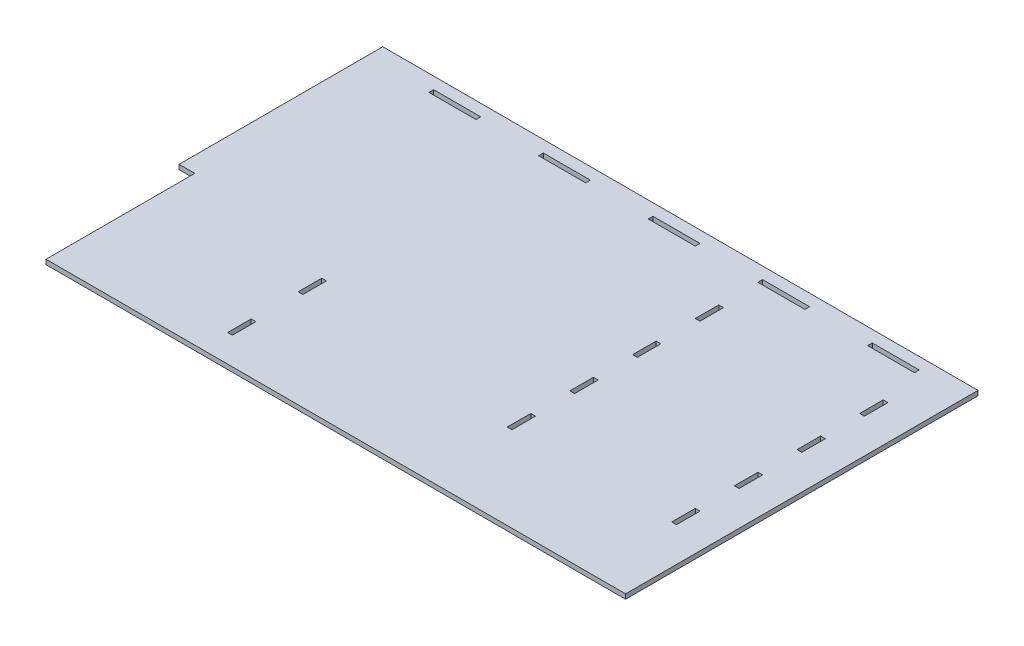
from build123d import *

# Parameters (mm, degrees)
SKETCH1_W           = 390
SKETCH1_H           = 225
BOSS_EXTRUDE1_DEPTH = 3
SKETCH2_W           = 30
SKETCH2_H           = 3
CUT_EXTRUDE1_DEPTH  = 3
SKETCH4_W           = 10
SKETCH4_H           = 225
CUT_EXTRUDE2_DEPTH  = 10
SKETCH6_W           = 10
SKETCH6_H           = 95
CUT_EXTRUDE4_DEPTH  = 3
SKETCH7_W           = 3
SKETCH7_H           = 15
CUT_EXTRUDE5_DEPTH  = 10
CUT_EXTRUDE6_DEPTH  = 442.626539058


with BuildPart() as part:
    # Sketch1 → Boss-Extrude1 (new body)
    with BuildSketch(Plane(origin=(0, 0, 0), x_dir=(1, 0, 0), z_dir=(0, 1, 0))):
        with Locations((195, 112.5)):
            Rectangle(SKETCH1_W, SKETCH1_H)
    extrude(amount=BOSS_EXTRUDE1_DEPTH)

    # Sketch2 → Cut-Extrude1 (cut)
    with BuildSketch(Plane(origin=(0, 3, 0), x_dir=(1, 0, 0), z_dir=(0, 1, 0))):
        with Locations((55, 216)):
            Rectangle(SKETCH2_W, SKETCH2_H)
        with Locations((125, 216)):
            Rectangle(SKETCH2_W, SKETCH2_H)
        with Locations((195, 216)):
            Rectangle(SKETCH2_W, SKETCH2_H)
        with Locations((265, 216)):
            Rectangle(SKETCH2_W, SKETCH2_H)
        with Locations((335, 216)):
            Rectangle(SKETCH2_W, SKETCH2_H)
    extrude(amount=-CUT_EXTRUDE1_DEPTH, mode=Mode.SUBTRACT)

    # Sketch4 → Cut-Extrude2 (cut)
    with BuildSketch(Plane(origin=(0, 3, 0), x_dir=(1, 0, 0), z_dir=(0, 1, 0))):
        with Locations((385, 112.5)):
            Rectangle(SKETCH4_W, SKETCH4_H)
    extrude(amount=-CUT_EXTRUDE2_DEPTH, mode=Mode.SUBTRACT)

    # Sketch6 → Cut-Extrude4 (cut)
    with BuildSketch(Plane(origin=(0, 3, 0), x_dir=(1, 0, 0), z_dir=(0, 1, 0))):
        with Locations((5, 47.5)):
            Rectangle(SKETCH6_W, SKETCH6_H)
    extrude(amount=-CUT_EXTRUDE4_DEPTH, mode=Mode.SUBTRACT)

    # Sketch7 → Cut-Extrude5 (cut)
    with BuildSketch(Plane(origin=(0, 3, 0), x_dir=(1, 0, 0), z_dir=(0, 1, 0))):
        with Locations((251.5, 182)):
            Rectangle(SKETCH7_W, SKETCH7_H)
        with Locations((251.5, 142)):
            Rectangle(SKETCH7_W, SKETCH7_H)
        with Locations((251.5, 102)):
            Rectangle(SKETCH7_W, SKETCH7_H)
        with Locations((251.5, 62)):
            Rectangle(SKETCH7_W, SKETCH7_H)
        with Locations((356.5, 62)):
            Rectangle(SKETCH7_W, SKETCH7_H)
        with Locations((356.5, 102)):
            Rectangle(SKETCH7_W, SKETCH7_H)
        with Locations((356.5, 142)):
            Rectangle(SKETCH7_W, SKETCH7_H)
        with Locations((356.5, 182)):
            Rectangle(SKETCH7_W, SKETCH7_H)
    extrude(amount=-CUT_EXTRUDE5_DEPTH, mode=Mode.SUBTRACT)

    # Sketch9 → Cut-Extrude6 (cut, through all)
    with BuildSketch(Plane(origin=(0, 3, 0), x_dir=(1, 0, 0), z_dir=(0, 1, 0))):
        Polygon((110, 62.5), (111.5, 62.5), (111.5, 77.5), (108.5, 77.5), (108.5, 62.5), align=None)
        Polygon((110, 32.5), (111.5, 32.5), (111.5, 17.5), (108.5, 17.5), (108.5, 32.5), align=None)
    extrude(amount=-CUT_EXTRUDE6_DEPTH, mode=Mode.SUBTRACT)


solid = part.part
